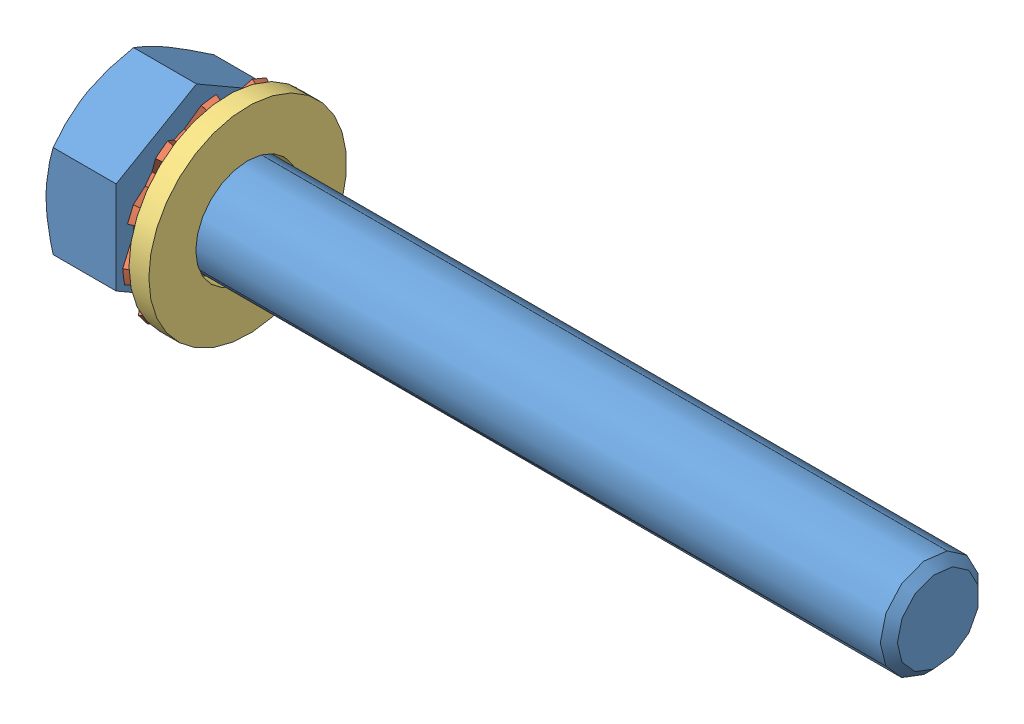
SolidWorks assembly Assemblage1.sldasm, configuration Défaut (file format 3400). Lengths in mm.
Overall size (65.67 20.54 20.54).
3 component instances, 3 part files, 4 mates.
Components (placement in the parent):
- Vis M8 60 mm-1: Vis M8 60 mm.SLDPRT [ISO 4018 - M8 x 60-NC] at origin size (65.67 15.01 13)
- Rondelle frein m8-1: Rondelle frein m8.SLDPRT [JIS B 1255 C 8] at (3.0769 0 0) x (-1 0 0) z (0 -0.924225 -0.381849) size (2.54 15.73 15.73)
- Rondelle M8-1: Rondelle M8.SLDPRT [Washer ISO 7089 - 8] at (9.8153 0 0) size (1.6 16 16)
Mates (geometry in assembly coordinates):
- Coaxiale11: concentric aligned: cylinder of ?; cone of ?
- Coïncidente1: coincident aligned: plane of ?; circle of ?
- Coaxiale2: concentric aligned: cylinder of ?; cylinder of ?
- Coïncidente2: coincident anti-aligned: circle of ?; plane of ?
